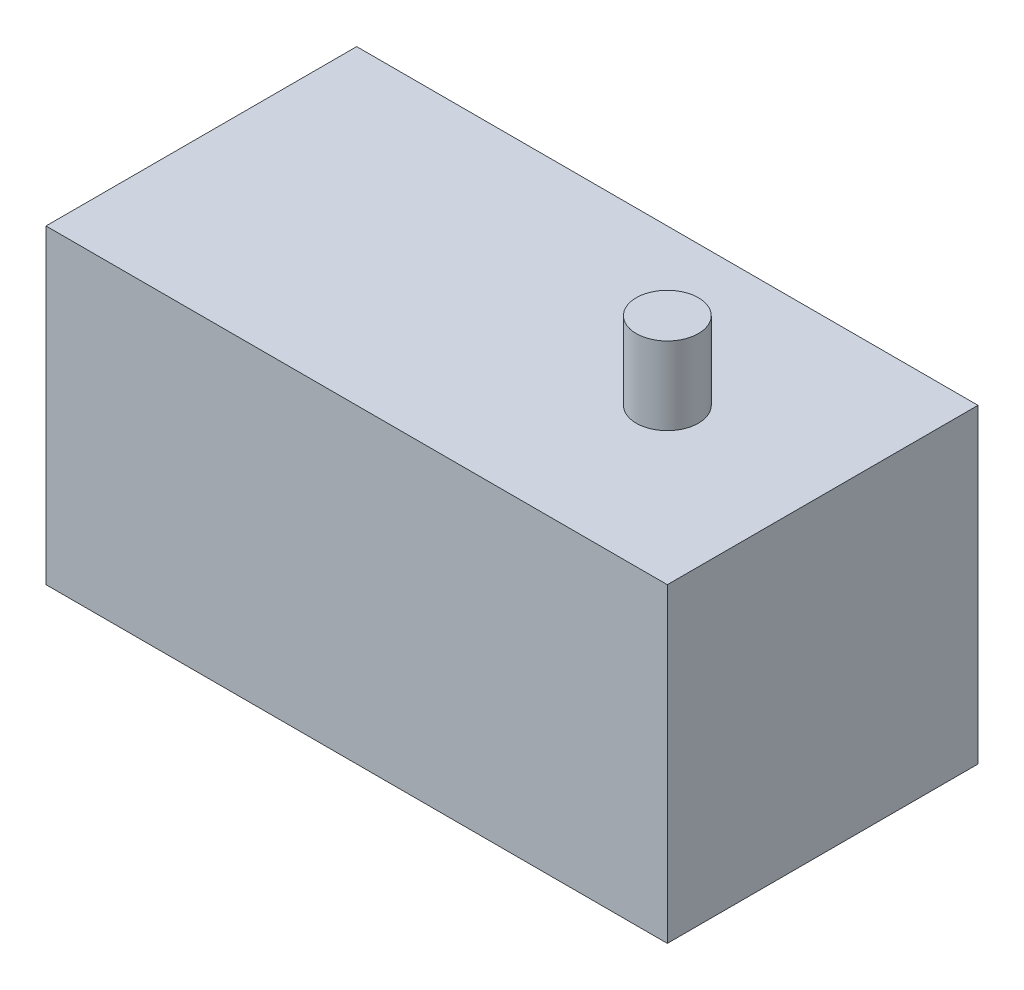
from build123d import *

# Parameters (mm, degrees)
SKETCH1_W           = 40
SKETCH1_H           = 20
BOSS_EXTRUDE1_DEPTH = 20
SKETCH2_R           = 2
BOSS_EXTRUDE2_DEPTH = 5
SKETCH3_W           = 5
SKETCH3_H           = 1.5
CUT_EXTRUDE1_DEPTH  = 5


with BuildPart() as part:
    # Sketch1 → Boss-Extrude1 (new body)
    with BuildSketch(Plane(origin=(0, 0, 0), x_dir=(1, 0, 0), z_dir=(0, 1, 0))):
        Rectangle(SKETCH1_W, SKETCH1_H)
    extrude(amount=BOSS_EXTRUDE1_DEPTH)

    # Sketch2 → Boss-Extrude2 (add)
    with BuildSketch(Plane(origin=(0, 20, 0), x_dir=(1, 0, 0), z_dir=(0, 1, 0))):
        with Locations(Location((10, 0, 0), (0, 0, 270))):
            Circle(SKETCH2_R)
    extrude(amount=BOSS_EXTRUDE2_DEPTH)

    # Sketch3 → Cut-Extrude1 (cut)
    with BuildSketch(Plane.ZY.offset(20)):
        with Locations((-0.267250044, 5)):
            Rectangle(SKETCH3_W, SKETCH3_H)
    extrude(amount=-CUT_EXTRUDE1_DEPTH, mode=Mode.SUBTRACT)


solid = part.part
